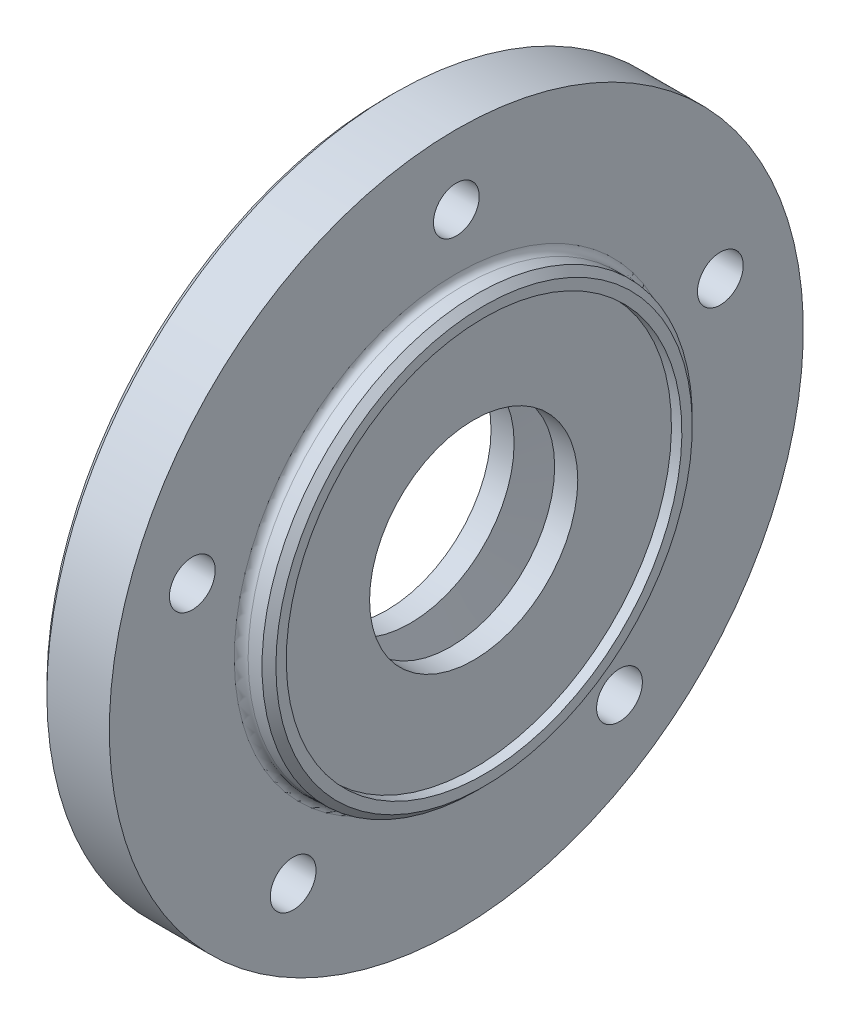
ISO-10303-21;
HEADER;
FILE_DESCRIPTION(('STEP AP214'),'2;1');
FILE_NAME('part.step','',(''),(''),'','','');
FILE_SCHEMA(('AUTOMOTIVE_DESIGN { 1 0 10303 214 1 1 1 1 }'));
ENDSEC;
DATA;
#1=APPLICATION_CONTEXT('core data for automotive mechanical design processes');
#2=APPLICATION_PROTOCOL_DEFINITION('international standard','automotive_design',2000,#1);
#3=PRODUCT_CONTEXT('',#1,'mechanical');
#4=PRODUCT('Part','Part','',(#3));
#5=PRODUCT_RELATED_PRODUCT_CATEGORY('part','',(#4));
#6=PRODUCT_DEFINITION_FORMATION('','',#4);
#7=PRODUCT_DEFINITION_CONTEXT('part definition',#1,'design');
#8=PRODUCT_DEFINITION('design','',#6,#7);
#9=PRODUCT_DEFINITION_SHAPE('','',#8);
#10=(LENGTH_UNIT() NAMED_UNIT(*) SI_UNIT(.MILLI.,.METRE.));
#11=(NAMED_UNIT(*) PLANE_ANGLE_UNIT() SI_UNIT($,.RADIAN.));
#12=(NAMED_UNIT(*) SI_UNIT($,.STERADIAN.) SOLID_ANGLE_UNIT());
#13=UNCERTAINTY_MEASURE_WITH_UNIT(LENGTH_MEASURE(1.E-05),#10,'distance_accuracy_value','');
#14=(GEOMETRIC_REPRESENTATION_CONTEXT(3) GLOBAL_UNCERTAINTY_ASSIGNED_CONTEXT((#13)) GLOBAL_UNIT_ASSIGNED_CONTEXT((#10,
#11,#12)) REPRESENTATION_CONTEXT('',''));
#15=CARTESIAN_POINT('',(0.,0.,0.));
#16=DIRECTION('',(0.,0.,1.));
#17=DIRECTION('',(1.,0.,0.));
#18=AXIS2_PLACEMENT_3D('',#15,#16,#17);
#19=CARTESIAN_POINT('',(11.,0.,0.));
#20=DIRECTION('',(1.,0.,0.));
#21=DIRECTION('',(0.,1.,0.));
#22=AXIS2_PLACEMENT_3D('',#19,#20,#21);
#23=TOROIDAL_SURFACE('',#22,32.,1.);
#24=CARTESIAN_POINT('',(9.99999999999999,0.,0.));
#25=DIRECTION('',(1.,0.,0.));
#26=DIRECTION('',(0.,1.,0.));
#27=AXIS2_PLACEMENT_3D('',#24,#25,#26);
#28=CIRCLE('',#27,32.);
#29=CARTESIAN_POINT('',(9.99999999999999,32.,0.));
#30=VERTEX_POINT('',#29);
#31=EDGE_CURVE('E8',#30,#30,#28,.T.);
#32=ORIENTED_EDGE('',*,*,#31,.T.);
#33=EDGE_LOOP('',(#32));
#34=FACE_BOUND('',#33,.T.);
#35=CARTESIAN_POINT('',(11.,0.,0.));
#36=DIRECTION('',(-1.,0.,0.));
#37=DIRECTION('',(0.,0.,1.));
#38=AXIS2_PLACEMENT_3D('',#35,#36,#37);
#39=CIRCLE('',#38,31.);
#40=CARTESIAN_POINT('',(11.,0.,31.));
#41=VERTEX_POINT('',#40);
#42=EDGE_CURVE('E20',#41,#41,#39,.T.);
#43=ORIENTED_EDGE('',*,*,#42,.T.);
#44=EDGE_LOOP('',(#43));
#45=FACE_BOUND('',#44,.T.);
#46=ADVANCED_FACE('F12',(#34,#45),#23,.F.);
#47=CARTESIAN_POINT('',(12.,0.,0.));
#48=DIRECTION('',(1.,0.,0.));
#49=DIRECTION('',(0.,1.,0.));
#50=AXIS2_PLACEMENT_3D('',#47,#48,#49);
#51=CYLINDRICAL_SURFACE('',#50,31.);
#52=CARTESIAN_POINT('',(13.,0.,0.));
#53=DIRECTION('',(1.,0.,0.));
#54=DIRECTION('',(0.,1.,0.));
#55=AXIS2_PLACEMENT_3D('',#52,#53,#54);
#56=CIRCLE('',#55,31.);
#57=CARTESIAN_POINT('',(13.,31.,0.));
#58=VERTEX_POINT('',#57);
#59=EDGE_CURVE('E28',#58,#58,#56,.T.);
#60=ORIENTED_EDGE('',*,*,#59,.F.);
#61=EDGE_LOOP('',(#60));
#62=FACE_BOUND('',#61,.T.);
#63=ORIENTED_EDGE('',*,*,#42,.F.);
#64=EDGE_LOOP('',(#63));
#65=FACE_BOUND('',#64,.T.);
#66=ADVANCED_FACE('F140',(#62,#65),#51,.T.);
#67=CARTESIAN_POINT('',(9.99999999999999,40.5,0.));
#68=DIRECTION('',(1.,0.,0.));
#69=DIRECTION('',(0.,0.,-1.));
#70=AXIS2_PLACEMENT_3D('',#67,#68,#69);
#71=PLANE('',#70);
#72=CARTESIAN_POINT('',(9.99999999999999,0.,0.));
#73=DIRECTION('',(1.,0.,0.));
#74=DIRECTION('',(0.,1.,0.));
#75=AXIS2_PLACEMENT_3D('',#72,#73,#74);
#76=CIRCLE('',#75,50.);
#77=CARTESIAN_POINT('',(9.99999999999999,50.,0.));
#78=VERTEX_POINT('',#77);
#79=EDGE_CURVE('E25',#78,#78,#76,.T.);
#80=ORIENTED_EDGE('',*,*,#79,.T.);
#81=EDGE_LOOP('',(#80));
#82=FACE_BOUND('',#81,.T.);
#83=CARTESIAN_POINT('',(10.,40.,0.));
#84=DIRECTION('',(-1.,0.,0.));
#85=DIRECTION('',(0.,0.,1.));
#86=AXIS2_PLACEMENT_3D('',#83,#84,#85);
#87=CIRCLE('',#86,3.3);
#88=CARTESIAN_POINT('',(10.,40.,3.3));
#89=VERTEX_POINT('',#88);
#90=EDGE_CURVE('E35',#89,#89,#87,.T.);
#91=ORIENTED_EDGE('',*,*,#90,.T.);
#92=EDGE_LOOP('',(#91));
#93=FACE_BOUND('',#92,.T.);
#94=CARTESIAN_POINT('',(10.,12.3606797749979,-38.0422606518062));
#95=DIRECTION('',(-1.,0.,0.));
#96=DIRECTION('',(0.,0.,1.));
#97=AXIS2_PLACEMENT_3D('',#94,#95,#96);
#98=CIRCLE('',#97,3.3);
#99=CARTESIAN_POINT('',(10.,12.3606797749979,-34.7422606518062));
#100=VERTEX_POINT('',#99);
#101=EDGE_CURVE('E38',#100,#100,#98,.T.);
#102=ORIENTED_EDGE('',*,*,#101,.T.);
#103=EDGE_LOOP('',(#102));
#104=FACE_BOUND('',#103,.T.);
#105=CARTESIAN_POINT('',(10.,12.3606797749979,38.0422606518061));
#106=DIRECTION('',(-1.,0.,0.));
#107=DIRECTION('',(0.,0.,1.));
#108=AXIS2_PLACEMENT_3D('',#105,#106,#107);
#109=CIRCLE('',#108,3.3);
#110=CARTESIAN_POINT('',(10.,12.3606797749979,41.3422606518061));
#111=VERTEX_POINT('',#110);
#112=EDGE_CURVE('E41',#111,#111,#109,.T.);
#113=ORIENTED_EDGE('',*,*,#112,.T.);
#114=EDGE_LOOP('',(#113));
#115=FACE_BOUND('',#114,.T.);
#116=CARTESIAN_POINT('',(10.,-32.3606797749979,23.5114100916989));
#117=DIRECTION('',(-1.,0.,0.));
#118=DIRECTION('',(0.,0.,1.));
#119=AXIS2_PLACEMENT_3D('',#116,#117,#118);
#120=CIRCLE('',#119,3.3);
#121=CARTESIAN_POINT('',(10.,-32.3606797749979,26.8114100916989));
#122=VERTEX_POINT('',#121);
#123=EDGE_CURVE('E44',#122,#122,#120,.T.);
#124=ORIENTED_EDGE('',*,*,#123,.T.);
#125=EDGE_LOOP('',(#124));
#126=FACE_BOUND('',#125,.T.);
#127=CARTESIAN_POINT('',(10.,-32.3606797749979,-23.5114100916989));
#128=DIRECTION('',(-1.,0.,0.));
#129=DIRECTION('',(0.,0.,1.));
#130=AXIS2_PLACEMENT_3D('',#127,#128,#129);
#131=CIRCLE('',#130,3.3);
#132=CARTESIAN_POINT('',(10.,-32.3606797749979,-20.2114100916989));
#133=VERTEX_POINT('',#132);
#134=EDGE_CURVE('E47',#133,#133,#131,.T.);
#135=ORIENTED_EDGE('',*,*,#134,.T.);
#136=EDGE_LOOP('',(#135));
#137=FACE_BOUND('',#136,.T.);
#138=ORIENTED_EDGE('',*,*,#31,.F.);
#139=EDGE_LOOP('',(#138));
#140=FACE_BOUND('',#139,.T.);
#141=ADVANCED_FACE('F145',(#82,#93,#104,#115,#126,#137,#140),#71,.T.);
#142=CARTESIAN_POINT('',(4.4,-32.3606797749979,-23.5114100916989));
#143=DIRECTION('',(1.,0.,0.));
#144=DIRECTION('',(0.,0.,-1.));
#145=AXIS2_PLACEMENT_3D('',#142,#143,#144);
#146=PLANE('',#145);
#147=CARTESIAN_POINT('',(4.4,-32.3606797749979,-23.5114100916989));
#148=DIRECTION('',(-1.,0.,0.));
#149=DIRECTION('',(0.,0.,1.));
#150=AXIS2_PLACEMENT_3D('',#147,#148,#149);
#151=CIRCLE('',#150,5.5);
#152=CARTESIAN_POINT('',(4.4,-32.3606797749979,-18.0114100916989));
#153=VERTEX_POINT('',#152);
#154=EDGE_CURVE('E50',#153,#153,#151,.T.);
#155=ORIENTED_EDGE('',*,*,#154,.T.);
#156=EDGE_LOOP('',(#155));
#157=FACE_BOUND('',#156,.T.);
#158=CARTESIAN_POINT('',(4.4,-32.3606797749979,-23.5114100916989));
#159=DIRECTION('',(-1.,0.,0.));
#160=DIRECTION('',(0.,0.,1.));
#161=AXIS2_PLACEMENT_3D('',#158,#159,#160);
#162=CIRCLE('',#161,3.3);
#163=CARTESIAN_POINT('',(4.4,-32.3606797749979,-20.2114100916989));
#164=VERTEX_POINT('',#163);
#165=EDGE_CURVE('E53',#164,#164,#162,.T.);
#166=ORIENTED_EDGE('',*,*,#165,.F.);
#167=EDGE_LOOP('',(#166));
#168=FACE_BOUND('',#167,.T.);
#169=ADVANCED_FACE('F152',(#157,#168),#146,.F.);
#170=CARTESIAN_POINT('',(2.2,-32.3606797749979,-23.5114100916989));
#171=DIRECTION('',(-1.,0.,0.));
#172=DIRECTION('',(0.,0.,1.));
#173=AXIS2_PLACEMENT_3D('',#170,#171,#172);
#174=CYLINDRICAL_SURFACE('',#173,5.5);
#175=CARTESIAN_POINT('',(0.,-32.3606797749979,-23.5114100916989));
#176=DIRECTION('',(1.,0.,0.));
#177=DIRECTION('',(0.,1.,0.));
#178=AXIS2_PLACEMENT_3D('',#175,#176,#177);
#179=CIRCLE('',#178,5.5);
#180=CARTESIAN_POINT('',(0.,-26.8606797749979,-23.5114100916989));
#181=VERTEX_POINT('',#180);
#182=EDGE_CURVE('E57',#181,#181,#179,.T.);
#183=ORIENTED_EDGE('',*,*,#182,.F.);
#184=EDGE_LOOP('',(#183));
#185=FACE_BOUND('',#184,.T.);
#186=ORIENTED_EDGE('',*,*,#154,.F.);
#187=EDGE_LOOP('',(#186));
#188=FACE_BOUND('',#187,.T.);
#189=ADVANCED_FACE('F154',(#185,#188),#174,.F.);
#190=CARTESIAN_POINT('',(142.112631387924,-32.3606797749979,-23.5114100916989));
#191=DIRECTION('',(-1.,0.,0.));
#192=DIRECTION('',(0.,0.,1.));
#193=AXIS2_PLACEMENT_3D('',#190,#191,#192);
#194=CYLINDRICAL_SURFACE('',#193,3.3);
#195=ORIENTED_EDGE('',*,*,#134,.F.);
#196=EDGE_LOOP('',(#195));
#197=FACE_BOUND('',#196,.T.);
#198=ORIENTED_EDGE('',*,*,#165,.T.);
#199=EDGE_LOOP('',(#198));
#200=FACE_BOUND('',#199,.T.);
#201=ADVANCED_FACE('F157',(#197,#200),#194,.F.);
#202=CARTESIAN_POINT('',(4.4,-32.3606797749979,23.5114100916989));
#203=DIRECTION('',(1.,0.,0.));
#204=DIRECTION('',(0.,0.,-1.));
#205=AXIS2_PLACEMENT_3D('',#202,#203,#204);
#206=PLANE('',#205);
#207=CARTESIAN_POINT('',(4.4,-32.3606797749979,23.5114100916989));
#208=DIRECTION('',(-1.,0.,0.));
#209=DIRECTION('',(0.,0.,1.));
#210=AXIS2_PLACEMENT_3D('',#207,#208,#209);
#211=CIRCLE('',#210,5.5);
#212=CARTESIAN_POINT('',(4.4,-32.3606797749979,29.0114100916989));
#213=VERTEX_POINT('',#212);
#214=EDGE_CURVE('E56',#213,#213,#211,.T.);
#215=ORIENTED_EDGE('',*,*,#214,.T.);
#216=EDGE_LOOP('',(#215));
#217=FACE_BOUND('',#216,.T.);
#218=CARTESIAN_POINT('',(4.4,-32.3606797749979,23.5114100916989));
#219=DIRECTION('',(-1.,0.,0.));
#220=DIRECTION('',(0.,0.,1.));
#221=AXIS2_PLACEMENT_3D('',#218,#219,#220);
#222=CIRCLE('',#221,3.3);
#223=CARTESIAN_POINT('',(4.4,-32.3606797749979,26.8114100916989));
#224=VERTEX_POINT('',#223);
#225=EDGE_CURVE('E64',#224,#224,#222,.T.);
#226=ORIENTED_EDGE('',*,*,#225,.F.);
#227=EDGE_LOOP('',(#226));
#228=FACE_BOUND('',#227,.T.);
#229=ADVANCED_FACE('F161',(#217,#228),#206,.F.);
#230=CARTESIAN_POINT('',(2.2,-32.3606797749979,23.5114100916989));
#231=DIRECTION('',(-1.,0.,0.));
#232=DIRECTION('',(0.,0.,1.));
#233=AXIS2_PLACEMENT_3D('',#230,#231,#232);
#234=CYLINDRICAL_SURFACE('',#233,5.5);
#235=CARTESIAN_POINT('',(0.,-32.3606797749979,23.5114100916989));
#236=DIRECTION('',(1.,0.,0.));
#237=DIRECTION('',(0.,1.,0.));
#238=AXIS2_PLACEMENT_3D('',#235,#236,#237);
#239=CIRCLE('',#238,5.5);
#240=CARTESIAN_POINT('',(0.,-26.8606797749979,23.5114100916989));
#241=VERTEX_POINT('',#240);
#242=EDGE_CURVE('E61',#241,#241,#239,.T.);
#243=ORIENTED_EDGE('',*,*,#242,.F.);
#244=EDGE_LOOP('',(#243));
#245=FACE_BOUND('',#244,.T.);
#246=ORIENTED_EDGE('',*,*,#214,.F.);
#247=EDGE_LOOP('',(#246));
#248=FACE_BOUND('',#247,.T.);
#249=ADVANCED_FACE('F163',(#245,#248),#234,.F.);
#250=CARTESIAN_POINT('',(142.112631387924,-32.3606797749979,23.5114100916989));
#251=DIRECTION('',(-1.,0.,0.));
#252=DIRECTION('',(0.,0.,1.));
#253=AXIS2_PLACEMENT_3D('',#250,#251,#252);
#254=CYLINDRICAL_SURFACE('',#253,3.3);
#255=ORIENTED_EDGE('',*,*,#123,.F.);
#256=EDGE_LOOP('',(#255));
#257=FACE_BOUND('',#256,.T.);
#258=ORIENTED_EDGE('',*,*,#225,.T.);
#259=EDGE_LOOP('',(#258));
#260=FACE_BOUND('',#259,.T.);
#261=ADVANCED_FACE('F166',(#257,#260),#254,.F.);
#262=CARTESIAN_POINT('',(4.4,12.3606797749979,38.0422606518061));
#263=DIRECTION('',(1.,0.,0.));
#264=DIRECTION('',(0.,0.,-1.));
#265=AXIS2_PLACEMENT_3D('',#262,#263,#264);
#266=PLANE('',#265);
#267=CARTESIAN_POINT('',(4.4,12.3606797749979,38.0422606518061));
#268=DIRECTION('',(-1.,0.,0.));
#269=DIRECTION('',(0.,0.,1.));
#270=AXIS2_PLACEMENT_3D('',#267,#268,#269);
#271=CIRCLE('',#270,5.5);
#272=CARTESIAN_POINT('',(4.4,12.3606797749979,43.5422606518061));
#273=VERTEX_POINT('',#272);
#274=EDGE_CURVE('E67',#273,#273,#271,.T.);
#275=ORIENTED_EDGE('',*,*,#274,.T.);
#276=EDGE_LOOP('',(#275));
#277=FACE_BOUND('',#276,.T.);
#278=CARTESIAN_POINT('',(4.4,12.3606797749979,38.0422606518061));
#279=DIRECTION('',(-1.,0.,0.));
#280=DIRECTION('',(0.,0.,1.));
#281=AXIS2_PLACEMENT_3D('',#278,#279,#280);
#282=CIRCLE('',#281,3.3);
#283=CARTESIAN_POINT('',(4.4,12.3606797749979,41.3422606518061));
#284=VERTEX_POINT('',#283);
#285=EDGE_CURVE('E73',#284,#284,#282,.T.);
#286=ORIENTED_EDGE('',*,*,#285,.F.);
#287=EDGE_LOOP('',(#286));
#288=FACE_BOUND('',#287,.T.);
#289=ADVANCED_FACE('F170',(#277,#288),#266,.F.);
#290=CARTESIAN_POINT('',(2.2,12.3606797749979,38.0422606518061));
#291=DIRECTION('',(-1.,0.,0.));
#292=DIRECTION('',(0.,0.,1.));
#293=AXIS2_PLACEMENT_3D('',#290,#291,#292);
#294=CYLINDRICAL_SURFACE('',#293,5.5);
#295=CARTESIAN_POINT('',(0.,12.3606797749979,38.0422606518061));
#296=DIRECTION('',(1.,0.,0.));
#297=DIRECTION('',(0.,1.,0.));
#298=AXIS2_PLACEMENT_3D('',#295,#296,#297);
#299=CIRCLE('',#298,5.5);
#300=CARTESIAN_POINT('',(0.,17.8606797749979,38.0422606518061));
#301=VERTEX_POINT('',#300);
#302=EDGE_CURVE('E70',#301,#301,#299,.T.);
#303=ORIENTED_EDGE('',*,*,#302,.F.);
#304=EDGE_LOOP('',(#303));
#305=FACE_BOUND('',#304,.T.);
#306=ORIENTED_EDGE('',*,*,#274,.F.);
#307=EDGE_LOOP('',(#306));
#308=FACE_BOUND('',#307,.T.);
#309=ADVANCED_FACE('F172',(#305,#308),#294,.F.);
#310=CARTESIAN_POINT('',(142.112631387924,12.3606797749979,38.0422606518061));
#311=DIRECTION('',(-1.,0.,0.));
#312=DIRECTION('',(0.,0.,1.));
#313=AXIS2_PLACEMENT_3D('',#310,#311,#312);
#314=CYLINDRICAL_SURFACE('',#313,3.3);
#315=ORIENTED_EDGE('',*,*,#112,.F.);
#316=EDGE_LOOP('',(#315));
#317=FACE_BOUND('',#316,.T.);
#318=ORIENTED_EDGE('',*,*,#285,.T.);
#319=EDGE_LOOP('',(#318));
#320=FACE_BOUND('',#319,.T.);
#321=ADVANCED_FACE('F175',(#317,#320),#314,.F.);
#322=CARTESIAN_POINT('',(4.4,12.3606797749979,-38.0422606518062));
#323=DIRECTION('',(1.,0.,0.));
#324=DIRECTION('',(0.,0.,-1.));
#325=AXIS2_PLACEMENT_3D('',#322,#323,#324);
#326=PLANE('',#325);
#327=CARTESIAN_POINT('',(4.4,12.3606797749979,-38.0422606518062));
#328=DIRECTION('',(-1.,0.,0.));
#329=DIRECTION('',(0.,0.,1.));
#330=AXIS2_PLACEMENT_3D('',#327,#328,#329);
#331=CIRCLE('',#330,5.5);
#332=CARTESIAN_POINT('',(4.4,12.3606797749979,-32.5422606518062));
#333=VERTEX_POINT('',#332);
#334=EDGE_CURVE('E76',#333,#333,#331,.T.);
#335=ORIENTED_EDGE('',*,*,#334,.T.);
#336=EDGE_LOOP('',(#335));
#337=FACE_BOUND('',#336,.T.);
#338=CARTESIAN_POINT('',(4.4,12.3606797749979,-38.0422606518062));
#339=DIRECTION('',(-1.,0.,0.));
#340=DIRECTION('',(0.,0.,1.));
#341=AXIS2_PLACEMENT_3D('',#338,#339,#340);
#342=CIRCLE('',#341,3.3);
#343=CARTESIAN_POINT('',(4.4,12.3606797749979,-34.7422606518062));
#344=VERTEX_POINT('',#343);
#345=EDGE_CURVE('E82',#344,#344,#342,.T.);
#346=ORIENTED_EDGE('',*,*,#345,.F.);
#347=EDGE_LOOP('',(#346));
#348=FACE_BOUND('',#347,.T.);
#349=ADVANCED_FACE('F179',(#337,#348),#326,.F.);
#350=CARTESIAN_POINT('',(2.2,12.3606797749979,-38.0422606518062));
#351=DIRECTION('',(-1.,0.,0.));
#352=DIRECTION('',(0.,0.,1.));
#353=AXIS2_PLACEMENT_3D('',#350,#351,#352);
#354=CYLINDRICAL_SURFACE('',#353,5.5);
#355=CARTESIAN_POINT('',(0.,12.3606797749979,-38.0422606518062));
#356=DIRECTION('',(1.,0.,0.));
#357=DIRECTION('',(0.,1.,0.));
#358=AXIS2_PLACEMENT_3D('',#355,#356,#357);
#359=CIRCLE('',#358,5.5);
#360=CARTESIAN_POINT('',(0.,17.8606797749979,-38.0422606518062));
#361=VERTEX_POINT('',#360);
#362=EDGE_CURVE('E79',#361,#361,#359,.T.);
#363=ORIENTED_EDGE('',*,*,#362,.F.);
#364=EDGE_LOOP('',(#363));
#365=FACE_BOUND('',#364,.T.);
#366=ORIENTED_EDGE('',*,*,#334,.F.);
#367=EDGE_LOOP('',(#366));
#368=FACE_BOUND('',#367,.T.);
#369=ADVANCED_FACE('F181',(#365,#368),#354,.F.);
#370=CARTESIAN_POINT('',(142.112631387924,12.3606797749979,-38.0422606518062));
#371=DIRECTION('',(-1.,0.,0.));
#372=DIRECTION('',(0.,0.,1.));
#373=AXIS2_PLACEMENT_3D('',#370,#371,#372);
#374=CYLINDRICAL_SURFACE('',#373,3.3);
#375=ORIENTED_EDGE('',*,*,#101,.F.);
#376=EDGE_LOOP('',(#375));
#377=FACE_BOUND('',#376,.T.);
#378=ORIENTED_EDGE('',*,*,#345,.T.);
#379=EDGE_LOOP('',(#378));
#380=FACE_BOUND('',#379,.T.);
#381=ADVANCED_FACE('F184',(#377,#380),#374,.F.);
#382=CARTESIAN_POINT('',(4.4,40.,0.));
#383=DIRECTION('',(1.,0.,0.));
#384=DIRECTION('',(0.,0.,-1.));
#385=AXIS2_PLACEMENT_3D('',#382,#383,#384);
#386=PLANE('',#385);
#387=CARTESIAN_POINT('',(4.4,40.,0.));
#388=DIRECTION('',(-1.,0.,0.));
#389=DIRECTION('',(0.,0.,1.));
#390=AXIS2_PLACEMENT_3D('',#387,#388,#389);
#391=CIRCLE('',#390,5.5);
#392=CARTESIAN_POINT('',(4.4,40.,5.5));
#393=VERTEX_POINT('',#392);
#394=EDGE_CURVE('E85',#393,#393,#391,.T.);
#395=ORIENTED_EDGE('',*,*,#394,.T.);
#396=EDGE_LOOP('',(#395));
#397=FACE_BOUND('',#396,.T.);
#398=CARTESIAN_POINT('',(4.4,40.,0.));
#399=DIRECTION('',(-1.,0.,0.));
#400=DIRECTION('',(0.,0.,1.));
#401=AXIS2_PLACEMENT_3D('',#398,#399,#400);
#402=CIRCLE('',#401,3.3);
#403=CARTESIAN_POINT('',(4.4,40.,3.3));
#404=VERTEX_POINT('',#403);
#405=EDGE_CURVE('E31',#404,#404,#402,.T.);
#406=ORIENTED_EDGE('',*,*,#405,.F.);
#407=EDGE_LOOP('',(#406));
#408=FACE_BOUND('',#407,.T.);
#409=ADVANCED_FACE('F188',(#397,#408),#386,.F.);
#410=CARTESIAN_POINT('',(2.2,40.,0.));
#411=DIRECTION('',(-1.,0.,0.));
#412=DIRECTION('',(0.,0.,1.));
#413=AXIS2_PLACEMENT_3D('',#410,#411,#412);
#414=CYLINDRICAL_SURFACE('',#413,5.5);
#415=CARTESIAN_POINT('',(0.,40.,0.));
#416=DIRECTION('',(1.,0.,0.));
#417=DIRECTION('',(0.,1.,0.));
#418=AXIS2_PLACEMENT_3D('',#415,#416,#417);
#419=CIRCLE('',#418,5.5);
#420=CARTESIAN_POINT('',(0.,45.5,0.));
#421=VERTEX_POINT('',#420);
#422=EDGE_CURVE('E88',#421,#421,#419,.T.);
#423=ORIENTED_EDGE('',*,*,#422,.F.);
#424=EDGE_LOOP('',(#423));
#425=FACE_BOUND('',#424,.T.);
#426=ORIENTED_EDGE('',*,*,#394,.F.);
#427=EDGE_LOOP('',(#426));
#428=FACE_BOUND('',#427,.T.);
#429=ADVANCED_FACE('F190',(#425,#428),#414,.F.);
#430=CARTESIAN_POINT('',(142.112631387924,40.,0.));
#431=DIRECTION('',(-1.,0.,0.));
#432=DIRECTION('',(0.,0.,1.));
#433=AXIS2_PLACEMENT_3D('',#430,#431,#432);
#434=CYLINDRICAL_SURFACE('',#433,3.3);
#435=ORIENTED_EDGE('',*,*,#90,.F.);
#436=EDGE_LOOP('',(#435));
#437=FACE_BOUND('',#436,.T.);
#438=ORIENTED_EDGE('',*,*,#405,.T.);
#439=EDGE_LOOP('',(#438));
#440=FACE_BOUND('',#439,.T.);
#441=ADVANCED_FACE('F193',(#437,#440),#434,.F.);
#442=CARTESIAN_POINT('',(13.5,0.,0.));
#443=DIRECTION('',(-1.,0.,0.));
#444=DIRECTION('',(0.,1.,0.));
#445=AXIS2_PLACEMENT_3D('',#442,#443,#444);
#446=CONICAL_SURFACE('',#445,30.5,0.785398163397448);
#447=ORIENTED_EDGE('',*,*,#59,.T.);
#448=EDGE_LOOP('',(#447));
#449=FACE_BOUND('',#448,.T.);
#450=CARTESIAN_POINT('',(14.,0.,0.));
#451=DIRECTION('',(-1.,0.,0.));
#452=DIRECTION('',(0.,0.,1.));
#453=AXIS2_PLACEMENT_3D('',#450,#451,#452);
#454=CIRCLE('',#453,30.);
#455=CARTESIAN_POINT('',(14.,0.,30.));
#456=VERTEX_POINT('',#455);
#457=EDGE_CURVE('E32',#456,#456,#454,.T.);
#458=ORIENTED_EDGE('',*,*,#457,.T.);
#459=EDGE_LOOP('',(#458));
#460=FACE_BOUND('',#459,.T.);
#461=ADVANCED_FACE('F197',(#449,#460),#446,.T.);
#462=CARTESIAN_POINT('',(14.,29.75,0.));
#463=DIRECTION('',(1.,0.,0.));
#464=DIRECTION('',(0.,0.,-1.));
#465=AXIS2_PLACEMENT_3D('',#462,#463,#464);
#466=PLANE('',#465);
#467=CARTESIAN_POINT('',(14.,0.,0.));
#468=DIRECTION('',(1.,0.,0.));
#469=DIRECTION('',(0.,1.,0.));
#470=AXIS2_PLACEMENT_3D('',#467,#468,#469);
#471=CIRCLE('',#470,28.5);
#472=CARTESIAN_POINT('',(14.,28.5,0.));
#473=VERTEX_POINT('',#472);
#474=EDGE_CURVE('E99',#473,#473,#471,.T.);
#475=ORIENTED_EDGE('',*,*,#474,.F.);
#476=EDGE_LOOP('',(#475));
#477=FACE_BOUND('',#476,.T.);
#478=ORIENTED_EDGE('',*,*,#457,.F.);
#479=EDGE_LOOP('',(#478));
#480=FACE_BOUND('',#479,.T.);
#481=ADVANCED_FACE('F199',(#477,#480),#466,.T.);
#482=CARTESIAN_POINT('',(0.5,0.,0.));
#483=DIRECTION('',(1.,0.,0.));
#484=DIRECTION('',(0.,1.,0.));
#485=AXIS2_PLACEMENT_3D('',#482,#483,#484);
#486=CONICAL_SURFACE('',#485,49.5,0.785398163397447);
#487=CARTESIAN_POINT('',(0.,0.,0.));
#488=DIRECTION('',(1.,0.,0.));
#489=DIRECTION('',(0.,1.,0.));
#490=AXIS2_PLACEMENT_3D('',#487,#488,#489);
#491=CIRCLE('',#490,49.);
#492=CARTESIAN_POINT('',(0.,49.,0.));
#493=VERTEX_POINT('',#492);
#494=EDGE_CURVE('E98',#493,#493,#491,.T.);
#495=ORIENTED_EDGE('',*,*,#494,.T.);
#496=EDGE_LOOP('',(#495));
#497=FACE_BOUND('',#496,.T.);
#498=CARTESIAN_POINT('',(1.,0.,0.));
#499=DIRECTION('',(-1.,0.,0.));
#500=DIRECTION('',(0.,0.,1.));
#501=AXIS2_PLACEMENT_3D('',#498,#499,#500);
#502=CIRCLE('',#501,50.);
#503=CARTESIAN_POINT('',(1.,0.,50.));
#504=VERTEX_POINT('',#503);
#505=EDGE_CURVE('E60',#504,#504,#502,.T.);
#506=ORIENTED_EDGE('',*,*,#505,.T.);
#507=EDGE_LOOP('',(#506));
#508=FACE_BOUND('',#507,.T.);
#509=ADVANCED_FACE('F202',(#497,#508),#486,.T.);
#510=CARTESIAN_POINT('',(5.,0.,0.));
#511=DIRECTION('',(1.,0.,0.));
#512=DIRECTION('',(0.,1.,0.));
#513=AXIS2_PLACEMENT_3D('',#510,#511,#512);
#514=CYLINDRICAL_SURFACE('',#513,50.);
#515=ORIENTED_EDGE('',*,*,#79,.F.);
#516=EDGE_LOOP('',(#515));
#517=FACE_BOUND('',#516,.T.);
#518=ORIENTED_EDGE('',*,*,#505,.F.);
#519=EDGE_LOOP('',(#518));
#520=FACE_BOUND('',#519,.T.);
#521=ADVANCED_FACE('F208',(#517,#520),#514,.T.);
#522=CARTESIAN_POINT('',(0.,32.5,0.));
#523=DIRECTION('',(-1.,0.,0.));
#524=DIRECTION('',(0.,0.,1.));
#525=AXIS2_PLACEMENT_3D('',#522,#523,#524);
#526=PLANE('',#525);
#527=ORIENTED_EDGE('',*,*,#182,.T.);
#528=EDGE_LOOP('',(#527));
#529=FACE_BOUND('',#528,.T.);
#530=ORIENTED_EDGE('',*,*,#242,.T.);
#531=EDGE_LOOP('',(#530));
#532=FACE_BOUND('',#531,.T.);
#533=ORIENTED_EDGE('',*,*,#302,.T.);
#534=EDGE_LOOP('',(#533));
#535=FACE_BOUND('',#534,.T.);
#536=ORIENTED_EDGE('',*,*,#362,.T.);
#537=EDGE_LOOP('',(#536));
#538=FACE_BOUND('',#537,.T.);
#539=ORIENTED_EDGE('',*,*,#422,.T.);
#540=EDGE_LOOP('',(#539));
#541=FACE_BOUND('',#540,.T.);
#542=CARTESIAN_POINT('',(0.,0.,0.));
#543=DIRECTION('',(1.,0.,0.));
#544=DIRECTION('',(0.,1.,0.));
#545=AXIS2_PLACEMENT_3D('',#542,#543,#544);
#546=CIRCLE('',#545,15.);
#547=CARTESIAN_POINT('',(0.,15.,0.));
#548=VERTEX_POINT('',#547);
#549=EDGE_CURVE('E95',#548,#548,#546,.T.);
#550=ORIENTED_EDGE('',*,*,#549,.T.);
#551=EDGE_LOOP('',(#550));
#552=FACE_BOUND('',#551,.T.);
#553=ORIENTED_EDGE('',*,*,#494,.F.);
#554=EDGE_LOOP('',(#553));
#555=FACE_BOUND('',#554,.T.);
#556=ADVANCED_FACE('F204',(#529,#532,#535,#538,#541,#552,#555),#526,.T.);
#557=CARTESIAN_POINT('',(13.25,0.,0.));
#558=DIRECTION('',(1.,0.,0.));
#559=DIRECTION('',(0.,1.,0.));
#560=AXIS2_PLACEMENT_3D('',#557,#558,#559);
#561=CYLINDRICAL_SURFACE('',#560,28.5);
#562=CARTESIAN_POINT('',(12.5,0.,0.));
#563=DIRECTION('',(1.,0.,0.));
#564=DIRECTION('',(0.,1.,0.));
#565=AXIS2_PLACEMENT_3D('',#562,#563,#564);
#566=CIRCLE('',#565,28.5);
#567=CARTESIAN_POINT('',(12.5,28.5,0.));
#568=VERTEX_POINT('',#567);
#569=EDGE_CURVE('E102',#568,#568,#566,.T.);
#570=ORIENTED_EDGE('',*,*,#569,.F.);
#571=EDGE_LOOP('',(#570));
#572=FACE_BOUND('',#571,.T.);
#573=ORIENTED_EDGE('',*,*,#474,.T.);
#574=EDGE_LOOP('',(#573));
#575=FACE_BOUND('',#574,.T.);
#576=ADVANCED_FACE('F207',(#572,#575),#561,.F.);
#577=CARTESIAN_POINT('',(12.5,21.75,0.));
#578=DIRECTION('',(1.,0.,0.));
#579=DIRECTION('',(0.,0.,-1.));
#580=AXIS2_PLACEMENT_3D('',#577,#578,#579);
#581=PLANE('',#580);
#582=CARTESIAN_POINT('',(12.5,0.,0.));
#583=DIRECTION('',(1.,0.,0.));
#584=DIRECTION('',(0.,1.,0.));
#585=AXIS2_PLACEMENT_3D('',#582,#583,#584);
#586=CIRCLE('',#585,15.);
#587=CARTESIAN_POINT('',(12.5,15.,0.));
#588=VERTEX_POINT('',#587);
#589=EDGE_CURVE('E111',#588,#588,#586,.T.);
#590=ORIENTED_EDGE('',*,*,#589,.F.);
#591=EDGE_LOOP('',(#590));
#592=FACE_BOUND('',#591,.T.);
#593=ORIENTED_EDGE('',*,*,#569,.T.);
#594=EDGE_LOOP('',(#593));
#595=FACE_BOUND('',#594,.T.);
#596=ADVANCED_FACE('F210',(#592,#595),#581,.T.);
#597=CARTESIAN_POINT('',(10.8354421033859,0.,0.));
#598=DIRECTION('',(1.,0.,0.));
#599=DIRECTION('',(0.,1.,0.));
#600=AXIS2_PLACEMENT_3D('',#597,#598,#599);
#601=CYLINDRICAL_SURFACE('',#600,15.);
#602=CARTESIAN_POINT('',(9.17088420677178,0.,0.));
#603=DIRECTION('',(1.,0.,0.));
#604=DIRECTION('',(0.,1.,0.));
#605=AXIS2_PLACEMENT_3D('',#602,#603,#604);
#606=CIRCLE('',#605,15.);
#607=CARTESIAN_POINT('',(9.17088420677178,15.,0.));
#608=VERTEX_POINT('',#607);
#609=EDGE_CURVE('E114',#608,#608,#606,.T.);
#610=ORIENTED_EDGE('',*,*,#609,.F.);
#611=EDGE_LOOP('',(#610));
#612=FACE_BOUND('',#611,.T.);
#613=ORIENTED_EDGE('',*,*,#589,.T.);
#614=EDGE_LOOP('',(#613));
#615=FACE_BOUND('',#614,.T.);
#616=ADVANCED_FACE('F212',(#612,#615),#601,.F.);
#617=CARTESIAN_POINT('',(8.71044210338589,0.,0.));
#618=DIRECTION('',(-1.,0.,0.));
#619=DIRECTION('',(0.,1.,0.));
#620=AXIS2_PLACEMENT_3D('',#617,#618,#619);
#621=CONICAL_SURFACE('',#620,18.75,1.44862327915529);
#622=CARTESIAN_POINT('',(8.25,0.,0.));
#623=DIRECTION('',(1.,0.,0.));
#624=DIRECTION('',(0.,1.,0.));
#625=AXIS2_PLACEMENT_3D('',#622,#623,#624);
#626=CIRCLE('',#625,22.5);
#627=CARTESIAN_POINT('',(8.25,22.5,0.));
#628=VERTEX_POINT('',#627);
#629=EDGE_CURVE('E117',#628,#628,#626,.T.);
#630=ORIENTED_EDGE('',*,*,#629,.F.);
#631=EDGE_LOOP('',(#630));
#632=FACE_BOUND('',#631,.T.);
#633=ORIENTED_EDGE('',*,*,#609,.T.);
#634=EDGE_LOOP('',(#633));
#635=FACE_BOUND('',#634,.T.);
#636=ADVANCED_FACE('F136',(#632,#635),#621,.F.);
#637=CARTESIAN_POINT('',(6.25,0.,0.));
#638=DIRECTION('',(1.,0.,0.));
#639=DIRECTION('',(0.,1.,0.));
#640=AXIS2_PLACEMENT_3D('',#637,#638,#639);
#641=CYLINDRICAL_SURFACE('',#640,22.5);
#642=CARTESIAN_POINT('',(4.25,0.,0.));
#643=DIRECTION('',(1.,0.,0.));
#644=DIRECTION('',(0.,1.,0.));
#645=AXIS2_PLACEMENT_3D('',#642,#643,#644);
#646=CIRCLE('',#645,22.5);
#647=CARTESIAN_POINT('',(4.25,22.5,0.));
#648=VERTEX_POINT('',#647);
#649=EDGE_CURVE('E119',#648,#648,#646,.T.);
#650=ORIENTED_EDGE('',*,*,#649,.F.);
#651=EDGE_LOOP('',(#650));
#652=FACE_BOUND('',#651,.T.);
#653=ORIENTED_EDGE('',*,*,#629,.T.);
#654=EDGE_LOOP('',(#653));
#655=FACE_BOUND('',#654,.T.);
#656=ADVANCED_FACE('F129',(#652,#655),#641,.F.);
#657=CARTESIAN_POINT('',(3.78955789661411,0.,0.));
#658=DIRECTION('',(1.,0.,0.));
#659=DIRECTION('',(0.,1.,0.));
#660=AXIS2_PLACEMENT_3D('',#657,#658,#659);
#661=CONICAL_SURFACE('',#660,18.75,1.44862327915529);
#662=CARTESIAN_POINT('',(3.32911579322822,0.,0.));
#663=DIRECTION('',(1.,0.,0.));
#664=DIRECTION('',(0.,1.,0.));
#665=AXIS2_PLACEMENT_3D('',#662,#663,#664);
#666=CIRCLE('',#665,15.);
#667=CARTESIAN_POINT('',(3.32911579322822,15.,0.));
#668=VERTEX_POINT('',#667);
#669=EDGE_CURVE('E16',#668,#668,#666,.T.);
#670=ORIENTED_EDGE('',*,*,#669,.F.);
#671=EDGE_LOOP('',(#670));
#672=FACE_BOUND('',#671,.T.);
#673=ORIENTED_EDGE('',*,*,#649,.T.);
#674=EDGE_LOOP('',(#673));
#675=FACE_BOUND('',#674,.T.);
#676=ADVANCED_FACE('F14',(#672,#675),#661,.F.);
#677=CARTESIAN_POINT('',(1.66455789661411,0.,0.));
#678=DIRECTION('',(1.,0.,0.));
#679=DIRECTION('',(0.,1.,0.));
#680=AXIS2_PLACEMENT_3D('',#677,#678,#679);
#681=CYLINDRICAL_SURFACE('',#680,15.);
#682=ORIENTED_EDGE('',*,*,#549,.F.);
#683=EDGE_LOOP('',(#682));
#684=FACE_BOUND('',#683,.T.);
#685=ORIENTED_EDGE('',*,*,#669,.T.);
#686=EDGE_LOOP('',(#685));
#687=FACE_BOUND('',#686,.T.);
#688=ADVANCED_FACE('F126',(#684,#687),#681,.F.);
#689=CLOSED_SHELL('',(#46,#66,#141,#169,#189,#201,#229,#249,#261,#289,#309,#321,#349,#369,#381,
#409,#429,#441,#461,#481,#509,#521,#556,#576,#596,#616,#636,#656,#676,#688));
#690=MANIFOLD_SOLID_BREP('B1',#689);
#691=ADVANCED_BREP_SHAPE_REPRESENTATION('',(#18,#690),#14);
#692=SHAPE_DEFINITION_REPRESENTATION(#9,#691);
ENDSEC;
END-ISO-10303-21;
